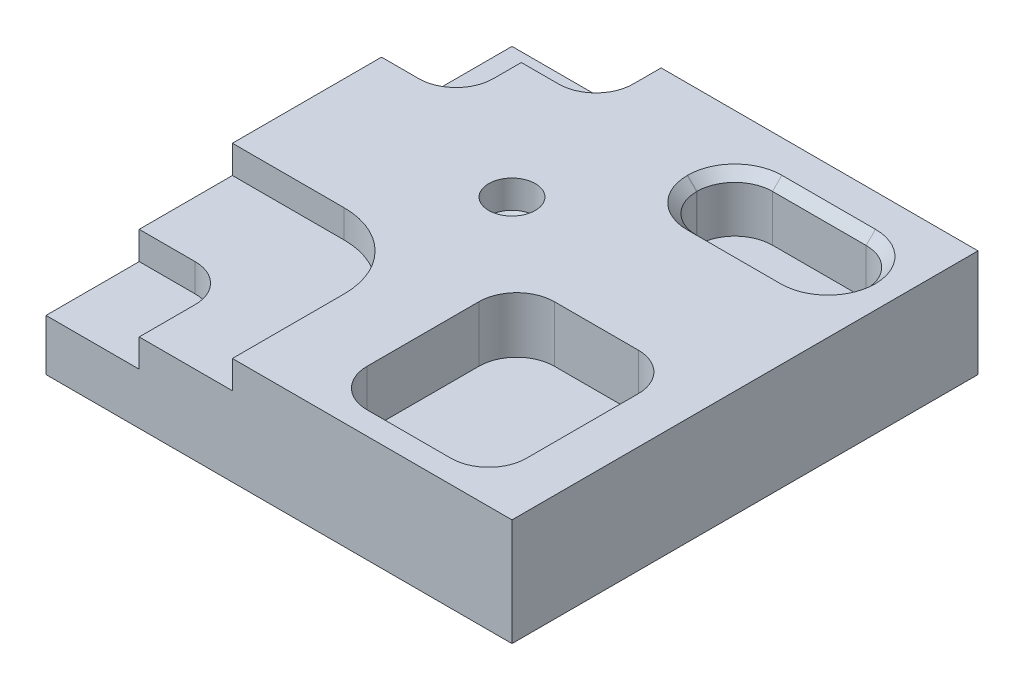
ISO-10303-21;
HEADER;
FILE_DESCRIPTION(('STEP AP214'),'2;1');
FILE_NAME('part.step','',(''),(''),'','','');
FILE_SCHEMA(('AUTOMOTIVE_DESIGN { 1 0 10303 214 1 1 1 1 }'));
ENDSEC;
DATA;
#1=APPLICATION_CONTEXT('core data for automotive mechanical design processes');
#2=APPLICATION_PROTOCOL_DEFINITION('international standard','automotive_design',2000,#1);
#3=PRODUCT_CONTEXT('',#1,'mechanical');
#4=PRODUCT('Part','Part','',(#3));
#5=PRODUCT_RELATED_PRODUCT_CATEGORY('part','',(#4));
#6=PRODUCT_DEFINITION_FORMATION('','',#4);
#7=PRODUCT_DEFINITION_CONTEXT('part definition',#1,'design');
#8=PRODUCT_DEFINITION('design','',#6,#7);
#9=PRODUCT_DEFINITION_SHAPE('','',#8);
#10=(LENGTH_UNIT() NAMED_UNIT(*) SI_UNIT(.MILLI.,.METRE.));
#11=(NAMED_UNIT(*) PLANE_ANGLE_UNIT() SI_UNIT($,.RADIAN.));
#12=(NAMED_UNIT(*) SI_UNIT($,.STERADIAN.) SOLID_ANGLE_UNIT());
#13=UNCERTAINTY_MEASURE_WITH_UNIT(LENGTH_MEASURE(1.E-05),#10,'distance_accuracy_value','');
#14=(GEOMETRIC_REPRESENTATION_CONTEXT(3) GLOBAL_UNCERTAINTY_ASSIGNED_CONTEXT((#13)) GLOBAL_UNIT_ASSIGNED_CONTEXT((#10,
#11,#12)) REPRESENTATION_CONTEXT('',''));
#15=CARTESIAN_POINT('',(0.,0.,0.));
#16=DIRECTION('',(0.,0.,1.));
#17=DIRECTION('',(1.,0.,0.));
#18=AXIS2_PLACEMENT_3D('',#15,#16,#17);
#19=CARTESIAN_POINT('',(-25.,11.5,25.));
#20=DIRECTION('',(1.,0.,0.));
#21=DIRECTION('',(0.,0.,-1.));
#22=AXIS2_PLACEMENT_3D('',#19,#20,#21);
#23=PLANE('',#22);
#24=DIRECTION('',(0.,0.,1.));
#25=VECTOR('',#24,1.);
#26=CARTESIAN_POINT('',(-25.,11.5,25.));
#27=LINE('',#26,#25);
#28=CARTESIAN_POINT('',(-25.,11.5,-11.));
#29=VERTEX_POINT('',#28);
#30=CARTESIAN_POINT('',(-25.,11.5,5.));
#31=VERTEX_POINT('',#30);
#32=EDGE_CURVE('E870',#29,#31,#27,.T.);
#33=ORIENTED_EDGE('',*,*,#32,.F.);
#34=DIRECTION('',(0.,1.,0.));
#35=VECTOR('',#34,1.);
#36=CARTESIAN_POINT('',(-25.,5.5,-11.));
#37=LINE('',#36,#35);
#38=CARTESIAN_POINT('',(-25.,5.5,-11.));
#39=VERTEX_POINT('',#38);
#40=EDGE_CURVE('E425',#39,#29,#37,.T.);
#41=ORIENTED_EDGE('',*,*,#40,.F.);
#42=DIRECTION('',(0.,0.,1.));
#43=VECTOR('',#42,1.);
#44=CARTESIAN_POINT('',(-25.,5.5,-25.));
#45=LINE('',#44,#43);
#46=CARTESIAN_POINT('',(-25.,5.5,-25.));
#47=VERTEX_POINT('',#46);
#48=EDGE_CURVE('E410',#47,#39,#45,.T.);
#49=ORIENTED_EDGE('',*,*,#48,.F.);
#50=DIRECTION('',(0.,-1.,0.));
#51=VECTOR('',#50,1.);
#52=CARTESIAN_POINT('',(-25.,11.5,-25.));
#53=LINE('',#52,#51);
#54=CARTESIAN_POINT('',(-25.,0.,-25.));
#55=VERTEX_POINT('',#54);
#56=EDGE_CURVE('E857',#47,#55,#53,.T.);
#57=ORIENTED_EDGE('',*,*,#56,.T.);
#58=DIRECTION('',(0.,0.,1.));
#59=VECTOR('',#58,1.);
#60=CARTESIAN_POINT('',(-25.,0.,25.));
#61=LINE('',#60,#59);
#62=CARTESIAN_POINT('',(-25.,0.,25.));
#63=VERTEX_POINT('',#62);
#64=EDGE_CURVE('E774',#55,#63,#61,.T.);
#65=ORIENTED_EDGE('',*,*,#64,.T.);
#66=DIRECTION('',(0.,-1.,0.));
#67=VECTOR('',#66,1.);
#68=CARTESIAN_POINT('',(-25.,11.5,25.));
#69=LINE('',#68,#67);
#70=CARTESIAN_POINT('',(-25.,5.5,25.));
#71=VERTEX_POINT('',#70);
#72=EDGE_CURVE('E802',#71,#63,#69,.T.);
#73=ORIENTED_EDGE('',*,*,#72,.F.);
#74=DIRECTION('',(0.,0.,1.));
#75=VECTOR('',#74,1.);
#76=CARTESIAN_POINT('',(-25.,5.5,0.));
#77=LINE('',#76,#75);
#78=CARTESIAN_POINT('',(-25.,5.5,15.));
#79=VERTEX_POINT('',#78);
#80=EDGE_CURVE('E767',#79,#71,#77,.T.);
#81=ORIENTED_EDGE('',*,*,#80,.F.);
#82=DIRECTION('',(0.,1.,0.));
#83=VECTOR('',#82,1.);
#84=CARTESIAN_POINT('',(-25.,5.5,15.));
#85=LINE('',#84,#83);
#86=CARTESIAN_POINT('',(-25.,8.5,15.));
#87=VERTEX_POINT('',#86);
#88=EDGE_CURVE('E766',#79,#87,#85,.T.);
#89=ORIENTED_EDGE('',*,*,#88,.T.);
#90=DIRECTION('',(0.,0.,1.));
#91=VECTOR('',#90,1.);
#92=CARTESIAN_POINT('',(-25.,8.5,25.));
#93=LINE('',#92,#91);
#94=CARTESIAN_POINT('',(-25.,8.5,5.));
#95=VERTEX_POINT('',#94);
#96=EDGE_CURVE('E734',#95,#87,#93,.T.);
#97=ORIENTED_EDGE('',*,*,#96,.F.);
#98=DIRECTION('',(0.,1.,0.));
#99=VECTOR('',#98,1.);
#100=CARTESIAN_POINT('',(-25.,8.5,5.));
#101=LINE('',#100,#99);
#102=EDGE_CURVE('E718',#95,#31,#101,.T.);
#103=ORIENTED_EDGE('',*,*,#102,.T.);
#104=EDGE_LOOP('',(#33,#41,#49,#57,#65,#73,#81,#89,#97,#103));
#105=FACE_BOUND('',#104,.T.);
#106=ADVANCED_FACE('F50',(#105),#23,.F.);
#107=CARTESIAN_POINT('',(0.,11.5,0.));
#108=DIRECTION('',(0.,1.,0.));
#109=DIRECTION('',(0.,0.,1.));
#110=AXIS2_PLACEMENT_3D('',#107,#108,#109);
#111=PLANE('',#110);
#112=DIRECTION('',(1.,0.,0.));
#113=VECTOR('',#112,1.);
#114=CARTESIAN_POINT('',(17.5,11.5,-21.5));
#115=LINE('',#114,#113);
#116=CARTESIAN_POINT('',(7.45,11.5,-21.5));
#117=VERTEX_POINT('',#116);
#118=CARTESIAN_POINT('',(17.5,11.5,-21.5));
#119=VERTEX_POINT('',#118);
#120=EDGE_CURVE('E519',#117,#119,#115,.T.);
#121=ORIENTED_EDGE('',*,*,#120,.T.);
#122=CARTESIAN_POINT('',(17.5,11.5,-16.45));
#123=DIRECTION('',(0.,1.,0.));
#124=DIRECTION('',(0.,0.,1.));
#125=AXIS2_PLACEMENT_3D('',#122,#123,#124);
#126=CIRCLE('',#125,5.04999999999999);
#127=CARTESIAN_POINT('',(22.55,11.5,-16.45));
#128=VERTEX_POINT('',#127);
#129=EDGE_CURVE('E523',#119,#128,#126,.F.);
#130=ORIENTED_EDGE('',*,*,#129,.T.);
#131=DIRECTION('',(0.,0.,1.));
#132=VECTOR('',#131,1.);
#133=CARTESIAN_POINT('',(22.55,11.5,-16.4));
#134=LINE('',#133,#132);
#135=CARTESIAN_POINT('',(22.55,11.5,-16.4));
#136=VERTEX_POINT('',#135);
#137=EDGE_CURVE('E515',#128,#136,#134,.T.);
#138=ORIENTED_EDGE('',*,*,#137,.T.);
#139=CARTESIAN_POINT('',(17.5,11.5,-16.4));
#140=DIRECTION('',(0.,1.,0.));
#141=DIRECTION('',(0.,0.,1.));
#142=AXIS2_PLACEMENT_3D('',#139,#140,#141);
#143=CIRCLE('',#142,5.05000000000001);
#144=CARTESIAN_POINT('',(17.5,11.5,-11.35));
#145=VERTEX_POINT('',#144);
#146=EDGE_CURVE('E509',#136,#145,#143,.F.);
#147=ORIENTED_EDGE('',*,*,#146,.T.);
#148=DIRECTION('',(-1.,0.,0.));
#149=VECTOR('',#148,1.);
#150=CARTESIAN_POINT('',(7.45,11.5,-11.35));
#151=LINE('',#150,#149);
#152=CARTESIAN_POINT('',(7.45,11.5,-11.35));
#153=VERTEX_POINT('',#152);
#154=EDGE_CURVE('E500',#145,#153,#151,.T.);
#155=ORIENTED_EDGE('',*,*,#154,.T.);
#156=CARTESIAN_POINT('',(7.45,11.5,-16.4));
#157=DIRECTION('',(0.,1.,0.));
#158=DIRECTION('',(0.,0.,1.));
#159=AXIS2_PLACEMENT_3D('',#156,#157,#158);
#160=CIRCLE('',#159,5.05000000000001);
#161=CARTESIAN_POINT('',(2.39999999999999,11.5,-16.4));
#162=VERTEX_POINT('',#161);
#163=EDGE_CURVE('E504',#153,#162,#160,.F.);
#164=ORIENTED_EDGE('',*,*,#163,.T.);
#165=DIRECTION('',(0.,0.,-1.));
#166=VECTOR('',#165,1.);
#167=CARTESIAN_POINT('',(2.39999999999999,11.5,-16.45));
#168=LINE('',#167,#166);
#169=CARTESIAN_POINT('',(2.39999999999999,11.5,-16.45));
#170=VERTEX_POINT('',#169);
#171=EDGE_CURVE('E512',#162,#170,#168,.T.);
#172=ORIENTED_EDGE('',*,*,#171,.T.);
#173=CARTESIAN_POINT('',(7.45,11.5,-16.45));
#174=DIRECTION('',(0.,1.,0.));
#175=DIRECTION('',(0.,0.,1.));
#176=AXIS2_PLACEMENT_3D('',#173,#174,#175);
#177=CIRCLE('',#176,5.04999999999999);
#178=EDGE_CURVE('E524',#170,#117,#177,.F.);
#179=ORIENTED_EDGE('',*,*,#178,.T.);
#180=EDGE_LOOP('',(#121,#130,#138,#147,#155,#164,#172,#179));
#181=FACE_BOUND('',#180,.T.);
#182=CARTESIAN_POINT('',(-4.99999999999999,11.5,-4.99999999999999));
#183=DIRECTION('',(0.,1.,0.));
#184=DIRECTION('',(0.,0.,1.));
#185=AXIS2_PLACEMENT_3D('',#182,#183,#184);
#186=CIRCLE('',#185,2.49999995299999);
#187=CARTESIAN_POINT('',(-4.99999999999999,11.5,-2.50000004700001));
#188=VERTEX_POINT('',#187);
#189=EDGE_CURVE('E1603',#188,#188,#186,.T.);
#190=ORIENTED_EDGE('',*,*,#189,.F.);
#191=EDGE_LOOP('',(#190));
#192=FACE_BOUND('',#191,.T.);
#193=DIRECTION('',(0.,0.,-1.));
#194=VECTOR('',#193,1.);
#195=CARTESIAN_POINT('',(-17.,11.5,-18.));
#196=LINE('',#195,#194);
#197=CARTESIAN_POINT('',(-17.,11.5,-15.));
#198=VERTEX_POINT('',#197);
#199=CARTESIAN_POINT('',(-17.,11.5,-18.));
#200=VERTEX_POINT('',#199);
#201=EDGE_CURVE('E360',#198,#200,#196,.T.);
#202=ORIENTED_EDGE('',*,*,#201,.F.);
#203=CARTESIAN_POINT('',(-21.,11.5,-15.));
#204=DIRECTION('',(0.,1.,0.));
#205=DIRECTION('',(0.,0.,1.));
#206=AXIS2_PLACEMENT_3D('',#203,#204,#205);
#207=CIRCLE('',#206,4.);
#208=CARTESIAN_POINT('',(-21.,11.5,-11.));
#209=VERTEX_POINT('',#208);
#210=EDGE_CURVE('E703',#198,#209,#207,.F.);
#211=ORIENTED_EDGE('',*,*,#210,.T.);
#212=DIRECTION('',(1.,0.,0.));
#213=VECTOR('',#212,1.);
#214=CARTESIAN_POINT('',(-25.,11.5,-11.));
#215=LINE('',#214,#213);
#216=EDGE_CURVE('E353',#29,#209,#215,.T.);
#217=ORIENTED_EDGE('',*,*,#216,.F.);
#218=ORIENTED_EDGE('',*,*,#32,.T.);
#219=DIRECTION('',(-1.,0.,0.));
#220=VECTOR('',#219,1.);
#221=CARTESIAN_POINT('',(-25.,11.5,5.));
#222=LINE('',#221,#220);
#223=CARTESIAN_POINT('',(-13.,11.5,5.));
#224=VERTEX_POINT('',#223);
#225=EDGE_CURVE('E737',#224,#31,#222,.T.);
#226=ORIENTED_EDGE('',*,*,#225,.F.);
#227=CARTESIAN_POINT('',(-13.,11.5,13.));
#228=DIRECTION('',(0.,1.,0.));
#229=DIRECTION('',(0.,0.,1.));
#230=AXIS2_PLACEMENT_3D('',#227,#228,#229);
#231=CIRCLE('',#230,8.);
#232=CARTESIAN_POINT('',(-5.,11.5,13.));
#233=VERTEX_POINT('',#232);
#234=EDGE_CURVE('E729',#224,#233,#231,.F.);
#235=ORIENTED_EDGE('',*,*,#234,.T.);
#236=DIRECTION('',(0.,0.,-1.));
#237=VECTOR('',#236,1.);
#238=CARTESIAN_POINT('',(-5.,11.5,25.));
#239=LINE('',#238,#237);
#240=CARTESIAN_POINT('',(-5.,11.5,25.));
#241=VERTEX_POINT('',#240);
#242=EDGE_CURVE('E753',#241,#233,#239,.T.);
#243=ORIENTED_EDGE('',*,*,#242,.F.);
#244=DIRECTION('',(1.,0.,0.));
#245=VECTOR('',#244,1.);
#246=CARTESIAN_POINT('',(25.,11.5,25.));
#247=LINE('',#246,#245);
#248=CARTESIAN_POINT('',(25.,11.5,25.));
#249=VERTEX_POINT('',#248);
#250=EDGE_CURVE('E867',#241,#249,#247,.T.);
#251=ORIENTED_EDGE('',*,*,#250,.T.);
#252=DIRECTION('',(0.,0.,-1.));
#253=VECTOR('',#252,1.);
#254=CARTESIAN_POINT('',(25.,11.5,25.));
#255=LINE('',#254,#253);
#256=CARTESIAN_POINT('',(25.,11.5,-25.));
#257=VERTEX_POINT('',#256);
#258=EDGE_CURVE('E864',#249,#257,#255,.T.);
#259=ORIENTED_EDGE('',*,*,#258,.T.);
#260=DIRECTION('',(-1.,0.,0.));
#261=VECTOR('',#260,1.);
#262=CARTESIAN_POINT('',(25.,11.5,-25.));
#263=LINE('',#262,#261);
#264=CARTESIAN_POINT('',(-9.,11.5,-25.));
#265=VERTEX_POINT('',#264);
#266=EDGE_CURVE('E860',#257,#265,#263,.T.);
#267=ORIENTED_EDGE('',*,*,#266,.T.);
#268=DIRECTION('',(0.,0.,-1.));
#269=VECTOR('',#268,1.);
#270=CARTESIAN_POINT('',(-9.,11.5,-25.));
#271=LINE('',#270,#269);
#272=CARTESIAN_POINT('',(-9.,11.5,-22.));
#273=VERTEX_POINT('',#272);
#274=EDGE_CURVE('E405',#273,#265,#271,.T.);
#275=ORIENTED_EDGE('',*,*,#274,.F.);
#276=CARTESIAN_POINT('',(-13.,11.5,-22.));
#277=DIRECTION('',(0.,1.,0.));
#278=DIRECTION('',(0.,0.,1.));
#279=AXIS2_PLACEMENT_3D('',#276,#277,#278);
#280=CIRCLE('',#279,4.);
#281=CARTESIAN_POINT('',(-13.,11.5,-18.));
#282=VERTEX_POINT('',#281);
#283=EDGE_CURVE('E811',#273,#282,#280,.F.);
#284=ORIENTED_EDGE('',*,*,#283,.T.);
#285=DIRECTION('',(1.,0.,0.));
#286=VECTOR('',#285,1.);
#287=CARTESIAN_POINT('',(-25.,11.5,-18.));
#288=LINE('',#287,#286);
#289=EDGE_CURVE('E400',#200,#282,#288,.T.);
#290=ORIENTED_EDGE('',*,*,#289,.F.);
#291=EDGE_LOOP('',(#202,#211,#217,#218,#226,#235,#243,#251,#259,#267,#275,#284,#290));
#292=FACE_BOUND('',#291,.T.);
#293=DIRECTION('',(0.,0.,-1.));
#294=VECTOR('',#293,1.);
#295=CARTESIAN_POINT('',(20.05,11.5,22.55));
#296=LINE('',#295,#294);
#297=CARTESIAN_POINT('',(20.05,11.5,18.5));
#298=VERTEX_POINT('',#297);
#299=CARTESIAN_POINT('',(20.05,11.5,6.50000000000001));
#300=VERTEX_POINT('',#299);
#301=EDGE_CURVE('E888',#298,#300,#296,.T.);
#302=ORIENTED_EDGE('',*,*,#301,.F.);
#303=CARTESIAN_POINT('',(16.,11.5,18.5));
#304=DIRECTION('',(0.,1.,0.));
#305=DIRECTION('',(0.,0.,1.));
#306=AXIS2_PLACEMENT_3D('',#303,#304,#305);
#307=CIRCLE('',#306,4.05);
#308=CARTESIAN_POINT('',(16.,11.5,22.55));
#309=VERTEX_POINT('',#308);
#310=EDGE_CURVE('E444',#298,#309,#307,.F.);
#311=ORIENTED_EDGE('',*,*,#310,.T.);
#312=DIRECTION('',(1.,0.,0.));
#313=VECTOR('',#312,1.);
#314=CARTESIAN_POINT('',(20.05,11.5,22.55));
#315=LINE('',#314,#313);
#316=CARTESIAN_POINT('',(7.,11.5,22.55));
#317=VERTEX_POINT('',#316);
#318=EDGE_CURVE('E1026',#317,#309,#315,.T.);
#319=ORIENTED_EDGE('',*,*,#318,.F.);
#320=CARTESIAN_POINT('',(7.,11.5,18.5));
#321=DIRECTION('',(0.,1.,0.));
#322=DIRECTION('',(0.,0.,1.));
#323=AXIS2_PLACEMENT_3D('',#320,#321,#322);
#324=CIRCLE('',#323,4.05);
#325=CARTESIAN_POINT('',(2.95,11.5,18.5));
#326=VERTEX_POINT('',#325);
#327=EDGE_CURVE('E447',#317,#326,#324,.F.);
#328=ORIENTED_EDGE('',*,*,#327,.T.);
#329=DIRECTION('',(0.,0.,1.));
#330=VECTOR('',#329,1.);
#331=CARTESIAN_POINT('',(2.95,11.5,22.55));
#332=LINE('',#331,#330);
#333=CARTESIAN_POINT('',(2.95,11.5,6.5));
#334=VERTEX_POINT('',#333);
#335=EDGE_CURVE('E1032',#334,#326,#332,.T.);
#336=ORIENTED_EDGE('',*,*,#335,.F.);
#337=CARTESIAN_POINT('',(7.,11.5,6.5));
#338=DIRECTION('',(0.,1.,0.));
#339=DIRECTION('',(0.,0.,1.));
#340=AXIS2_PLACEMENT_3D('',#337,#338,#339);
#341=CIRCLE('',#340,4.05);
#342=CARTESIAN_POINT('',(7.,11.5,2.45000000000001));
#343=VERTEX_POINT('',#342);
#344=EDGE_CURVE('E438',#334,#343,#341,.F.);
#345=ORIENTED_EDGE('',*,*,#344,.T.);
#346=DIRECTION('',(-1.,0.,0.));
#347=VECTOR('',#346,1.);
#348=CARTESIAN_POINT('',(20.05,11.5,2.45));
#349=LINE('',#348,#347);
#350=CARTESIAN_POINT('',(16.,11.5,2.45));
#351=VERTEX_POINT('',#350);
#352=EDGE_CURVE('E1038',#351,#343,#349,.T.);
#353=ORIENTED_EDGE('',*,*,#352,.F.);
#354=CARTESIAN_POINT('',(16.,11.5,6.50000000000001));
#355=DIRECTION('',(0.,1.,0.));
#356=DIRECTION('',(0.,0.,1.));
#357=AXIS2_PLACEMENT_3D('',#354,#355,#356);
#358=CIRCLE('',#357,4.05);
#359=EDGE_CURVE('E441',#351,#300,#358,.F.);
#360=ORIENTED_EDGE('',*,*,#359,.T.);
#361=EDGE_LOOP('',(#302,#311,#319,#328,#336,#345,#353,#360));
#362=FACE_BOUND('',#361,.T.);
#363=ADVANCED_FACE('F678',(#181,#192,#292,#362),#111,.T.);
#364=CARTESIAN_POINT('',(25.,11.5,25.));
#365=DIRECTION('',(0.,0.,-1.));
#366=DIRECTION('',(-1.,0.,0.));
#367=AXIS2_PLACEMENT_3D('',#364,#365,#366);
#368=PLANE('',#367);
#369=ORIENTED_EDGE('',*,*,#250,.F.);
#370=DIRECTION('',(0.,1.,0.));
#371=VECTOR('',#370,1.);
#372=CARTESIAN_POINT('',(-5.,8.5,25.));
#373=LINE('',#372,#371);
#374=CARTESIAN_POINT('',(-5.,8.5,25.));
#375=VERTEX_POINT('',#374);
#376=EDGE_CURVE('E716',#375,#241,#373,.T.);
#377=ORIENTED_EDGE('',*,*,#376,.F.);
#378=DIRECTION('',(1.,0.,0.));
#379=VECTOR('',#378,1.);
#380=CARTESIAN_POINT('',(-25.,8.5,25.));
#381=LINE('',#380,#379);
#382=CARTESIAN_POINT('',(-15.,8.5,25.));
#383=VERTEX_POINT('',#382);
#384=EDGE_CURVE('E736',#383,#375,#381,.T.);
#385=ORIENTED_EDGE('',*,*,#384,.F.);
#386=DIRECTION('',(0.,1.,0.));
#387=VECTOR('',#386,1.);
#388=CARTESIAN_POINT('',(-15.,5.5,25.));
#389=LINE('',#388,#387);
#390=CARTESIAN_POINT('',(-15.,5.5,25.));
#391=VERTEX_POINT('',#390);
#392=EDGE_CURVE('E763',#391,#383,#389,.T.);
#393=ORIENTED_EDGE('',*,*,#392,.F.);
#394=DIRECTION('',(1.,0.,0.));
#395=VECTOR('',#394,1.);
#396=CARTESIAN_POINT('',(0.,5.5,25.));
#397=LINE('',#396,#395);
#398=EDGE_CURVE('E776',#71,#391,#397,.T.);
#399=ORIENTED_EDGE('',*,*,#398,.F.);
#400=ORIENTED_EDGE('',*,*,#72,.T.);
#401=DIRECTION('',(1.,0.,0.));
#402=VECTOR('',#401,1.);
#403=CARTESIAN_POINT('',(25.,0.,25.));
#404=LINE('',#403,#402);
#405=CARTESIAN_POINT('',(25.,0.,25.));
#406=VERTEX_POINT('',#405);
#407=EDGE_CURVE('E880',#63,#406,#404,.T.);
#408=ORIENTED_EDGE('',*,*,#407,.T.);
#409=DIRECTION('',(0.,-1.,0.));
#410=VECTOR('',#409,1.);
#411=CARTESIAN_POINT('',(25.,11.5,25.));
#412=LINE('',#411,#410);
#413=EDGE_CURVE('E849',#249,#406,#412,.T.);
#414=ORIENTED_EDGE('',*,*,#413,.F.);
#415=EDGE_LOOP('',(#369,#377,#385,#393,#399,#400,#408,#414));
#416=FACE_BOUND('',#415,.T.);
#417=ADVANCED_FACE('F915',(#416),#368,.F.);
#418=CARTESIAN_POINT('',(25.,11.5,25.));
#419=DIRECTION('',(-1.,0.,0.));
#420=DIRECTION('',(0.,0.,1.));
#421=AXIS2_PLACEMENT_3D('',#418,#419,#420);
#422=PLANE('',#421);
#423=DIRECTION('',(0.,0.,-1.));
#424=VECTOR('',#423,1.);
#425=CARTESIAN_POINT('',(25.,0.,25.));
#426=LINE('',#425,#424);
#427=CARTESIAN_POINT('',(25.,0.,-25.));
#428=VERTEX_POINT('',#427);
#429=EDGE_CURVE('E877',#406,#428,#426,.T.);
#430=ORIENTED_EDGE('',*,*,#429,.T.);
#431=DIRECTION('',(0.,-1.,0.));
#432=VECTOR('',#431,1.);
#433=CARTESIAN_POINT('',(25.,11.5,-25.));
#434=LINE('',#433,#432);
#435=EDGE_CURVE('E853',#257,#428,#434,.T.);
#436=ORIENTED_EDGE('',*,*,#435,.F.);
#437=ORIENTED_EDGE('',*,*,#258,.F.);
#438=ORIENTED_EDGE('',*,*,#413,.T.);
#439=EDGE_LOOP('',(#430,#436,#437,#438));
#440=FACE_BOUND('',#439,.T.);
#441=ADVANCED_FACE('F922',(#440),#422,.F.);
#442=CARTESIAN_POINT('',(25.,11.5,-25.));
#443=DIRECTION('',(0.,0.,1.));
#444=DIRECTION('',(1.,0.,0.));
#445=AXIS2_PLACEMENT_3D('',#442,#443,#444);
#446=PLANE('',#445);
#447=DIRECTION('',(-1.,0.,0.));
#448=VECTOR('',#447,1.);
#449=CARTESIAN_POINT('',(-25.,5.5,-25.));
#450=LINE('',#449,#448);
#451=CARTESIAN_POINT('',(-9.,5.5,-25.));
#452=VERTEX_POINT('',#451);
#453=EDGE_CURVE('E394',#452,#47,#450,.T.);
#454=ORIENTED_EDGE('',*,*,#453,.F.);
#455=DIRECTION('',(0.,1.,0.));
#456=VECTOR('',#455,1.);
#457=CARTESIAN_POINT('',(-9.,5.5,-25.));
#458=LINE('',#457,#456);
#459=EDGE_CURVE('E399',#452,#265,#458,.T.);
#460=ORIENTED_EDGE('',*,*,#459,.T.);
#461=ORIENTED_EDGE('',*,*,#266,.F.);
#462=ORIENTED_EDGE('',*,*,#435,.T.);
#463=DIRECTION('',(-1.,0.,0.));
#464=VECTOR('',#463,1.);
#465=CARTESIAN_POINT('',(25.,0.,-25.));
#466=LINE('',#465,#464);
#467=EDGE_CURVE('E873',#428,#55,#466,.T.);
#468=ORIENTED_EDGE('',*,*,#467,.T.);
#469=ORIENTED_EDGE('',*,*,#56,.F.);
#470=EDGE_LOOP('',(#454,#460,#461,#462,#468,#469));
#471=FACE_BOUND('',#470,.T.);
#472=ADVANCED_FACE('F927',(#471),#446,.F.);
#473=CARTESIAN_POINT('',(0.,0.,0.));
#474=DIRECTION('',(0.,1.,0.));
#475=DIRECTION('',(0.,0.,1.));
#476=AXIS2_PLACEMENT_3D('',#473,#474,#475);
#477=PLANE('',#476);
#478=ORIENTED_EDGE('',*,*,#64,.F.);
#479=ORIENTED_EDGE('',*,*,#467,.F.);
#480=ORIENTED_EDGE('',*,*,#429,.F.);
#481=ORIENTED_EDGE('',*,*,#407,.F.);
#482=EDGE_LOOP('',(#478,#479,#480,#481));
#483=FACE_BOUND('',#482,.T.);
#484=ADVANCED_FACE('F1086',(#483),#477,.F.);
#485=CARTESIAN_POINT('',(0.,5.5,15.));
#486=DIRECTION('',(0.,0.,1.));
#487=DIRECTION('',(1.,0.,0.));
#488=AXIS2_PLACEMENT_3D('',#485,#486,#487);
#489=PLANE('',#488);
#490=DIRECTION('',(1.,0.,0.));
#491=VECTOR('',#490,1.);
#492=CARTESIAN_POINT('',(0.,5.5,15.));
#493=LINE('',#492,#491);
#494=CARTESIAN_POINT('',(-19.,5.5,15.));
#495=VERTEX_POINT('',#494);
#496=EDGE_CURVE('E782',#79,#495,#493,.T.);
#497=ORIENTED_EDGE('',*,*,#496,.T.);
#498=DIRECTION('',(0.,1.,0.));
#499=VECTOR('',#498,1.);
#500=CARTESIAN_POINT('',(-19.,5.5,15.));
#501=LINE('',#500,#499);
#502=CARTESIAN_POINT('',(-19.,8.5,15.));
#503=VERTEX_POINT('',#502);
#504=EDGE_CURVE('E749',#495,#503,#501,.T.);
#505=ORIENTED_EDGE('',*,*,#504,.T.);
#506=DIRECTION('',(1.,0.,0.));
#507=VECTOR('',#506,1.);
#508=CARTESIAN_POINT('',(0.,8.5,15.));
#509=LINE('',#508,#507);
#510=EDGE_CURVE('E726',#87,#503,#509,.T.);
#511=ORIENTED_EDGE('',*,*,#510,.F.);
#512=ORIENTED_EDGE('',*,*,#88,.F.);
#513=EDGE_LOOP('',(#497,#505,#511,#512));
#514=FACE_BOUND('',#513,.T.);
#515=ADVANCED_FACE('F1083',(#514),#489,.T.);
#516=CARTESIAN_POINT('',(-15.,5.5,0.));
#517=DIRECTION('',(1.,0.,0.));
#518=DIRECTION('',(0.,0.,-1.));
#519=AXIS2_PLACEMENT_3D('',#516,#517,#518);
#520=PLANE('',#519);
#521=DIRECTION('',(0.,0.,-1.));
#522=VECTOR('',#521,1.);
#523=CARTESIAN_POINT('',(-15.,8.5,0.));
#524=LINE('',#523,#522);
#525=CARTESIAN_POINT('',(-15.,8.5,19.));
#526=VERTEX_POINT('',#525);
#527=EDGE_CURVE('E715',#383,#526,#524,.T.);
#528=ORIENTED_EDGE('',*,*,#527,.T.);
#529=DIRECTION('',(0.,1.,0.));
#530=VECTOR('',#529,1.);
#531=CARTESIAN_POINT('',(-15.,5.5,19.));
#532=LINE('',#531,#530);
#533=CARTESIAN_POINT('',(-15.,5.5,19.));
#534=VERTEX_POINT('',#533);
#535=EDGE_CURVE('E761',#526,#534,#532,.F.);
#536=ORIENTED_EDGE('',*,*,#535,.T.);
#537=DIRECTION('',(0.,0.,-1.));
#538=VECTOR('',#537,1.);
#539=CARTESIAN_POINT('',(-15.,5.5,0.));
#540=LINE('',#539,#538);
#541=EDGE_CURVE('E779',#391,#534,#540,.T.);
#542=ORIENTED_EDGE('',*,*,#541,.F.);
#543=ORIENTED_EDGE('',*,*,#392,.T.);
#544=EDGE_LOOP('',(#528,#536,#542,#543));
#545=FACE_BOUND('',#544,.T.);
#546=ADVANCED_FACE('F1081',(#545),#520,.F.);
#547=CARTESIAN_POINT('',(0.,5.5,0.));
#548=DIRECTION('',(0.,1.,0.));
#549=DIRECTION('',(0.,0.,1.));
#550=AXIS2_PLACEMENT_3D('',#547,#548,#549);
#551=PLANE('',#550);
#552=ORIENTED_EDGE('',*,*,#541,.T.);
#553=CARTESIAN_POINT('',(-19.,5.5,19.));
#554=DIRECTION('',(0.,1.,0.));
#555=DIRECTION('',(0.,0.,1.));
#556=AXIS2_PLACEMENT_3D('',#553,#554,#555);
#557=CIRCLE('',#556,4.);
#558=EDGE_CURVE('E770',#534,#495,#557,.T.);
#559=ORIENTED_EDGE('',*,*,#558,.T.);
#560=ORIENTED_EDGE('',*,*,#496,.F.);
#561=ORIENTED_EDGE('',*,*,#80,.T.);
#562=ORIENTED_EDGE('',*,*,#398,.T.);
#563=EDGE_LOOP('',(#552,#559,#560,#561,#562));
#564=FACE_BOUND('',#563,.T.);
#565=ADVANCED_FACE('F1076',(#564),#551,.T.);
#566=CARTESIAN_POINT('',(-25.,8.5,5.));
#567=DIRECTION('',(0.,0.,-1.));
#568=DIRECTION('',(-1.,0.,0.));
#569=AXIS2_PLACEMENT_3D('',#566,#567,#568);
#570=PLANE('',#569);
#571=DIRECTION('',(-1.,0.,0.));
#572=VECTOR('',#571,1.);
#573=CARTESIAN_POINT('',(-25.,8.5,5.));
#574=LINE('',#573,#572);
#575=CARTESIAN_POINT('',(-13.,8.5,5.));
#576=VERTEX_POINT('',#575);
#577=EDGE_CURVE('E719',#576,#95,#574,.T.);
#578=ORIENTED_EDGE('',*,*,#577,.F.);
#579=DIRECTION('',(0.,1.,0.));
#580=VECTOR('',#579,1.);
#581=CARTESIAN_POINT('',(-13.,11.5,5.));
#582=LINE('',#581,#580);
#583=EDGE_CURVE('E711',#576,#224,#582,.T.);
#584=ORIENTED_EDGE('',*,*,#583,.T.);
#585=ORIENTED_EDGE('',*,*,#225,.T.);
#586=ORIENTED_EDGE('',*,*,#102,.F.);
#587=EDGE_LOOP('',(#578,#584,#585,#586));
#588=FACE_BOUND('',#587,.T.);
#589=ADVANCED_FACE('F899',(#588),#570,.F.);
#590=CARTESIAN_POINT('',(-5.,8.5,25.));
#591=DIRECTION('',(1.,0.,0.));
#592=DIRECTION('',(0.,0.,-1.));
#593=AXIS2_PLACEMENT_3D('',#590,#591,#592);
#594=PLANE('',#593);
#595=ORIENTED_EDGE('',*,*,#242,.T.);
#596=DIRECTION('',(0.,1.,0.));
#597=VECTOR('',#596,1.);
#598=CARTESIAN_POINT('',(-5.,8.5,13.));
#599=LINE('',#598,#597);
#600=CARTESIAN_POINT('',(-5.,8.5,13.));
#601=VERTEX_POINT('',#600);
#602=EDGE_CURVE('E714',#233,#601,#599,.F.);
#603=ORIENTED_EDGE('',*,*,#602,.T.);
#604=DIRECTION('',(0.,0.,-1.));
#605=VECTOR('',#604,1.);
#606=CARTESIAN_POINT('',(-5.,8.5,25.));
#607=LINE('',#606,#605);
#608=EDGE_CURVE('E732',#375,#601,#607,.T.);
#609=ORIENTED_EDGE('',*,*,#608,.F.);
#610=ORIENTED_EDGE('',*,*,#376,.T.);
#611=EDGE_LOOP('',(#595,#603,#609,#610));
#612=FACE_BOUND('',#611,.T.);
#613=ADVANCED_FACE('F906',(#612),#594,.F.);
#614=CARTESIAN_POINT('',(0.,8.5,0.));
#615=DIRECTION('',(0.,-1.,0.));
#616=DIRECTION('',(0.,0.,-1.));
#617=AXIS2_PLACEMENT_3D('',#614,#615,#616);
#618=PLANE('',#617);
#619=ORIENTED_EDGE('',*,*,#608,.T.);
#620=CARTESIAN_POINT('',(-13.,8.5,13.));
#621=DIRECTION('',(0.,-1.,0.));
#622=DIRECTION('',(0.,0.,-1.));
#623=AXIS2_PLACEMENT_3D('',#620,#621,#622);
#624=CIRCLE('',#623,8.);
#625=EDGE_CURVE('E722',#601,#576,#624,.F.);
#626=ORIENTED_EDGE('',*,*,#625,.T.);
#627=ORIENTED_EDGE('',*,*,#577,.T.);
#628=ORIENTED_EDGE('',*,*,#96,.T.);
#629=ORIENTED_EDGE('',*,*,#510,.T.);
#630=CARTESIAN_POINT('',(-19.,8.5,19.));
#631=DIRECTION('',(0.,-1.,0.));
#632=DIRECTION('',(0.,0.,-1.));
#633=AXIS2_PLACEMENT_3D('',#630,#631,#632);
#634=CIRCLE('',#633,4.);
#635=EDGE_CURVE('E788',#503,#526,#634,.T.);
#636=ORIENTED_EDGE('',*,*,#635,.T.);
#637=ORIENTED_EDGE('',*,*,#527,.F.);
#638=ORIENTED_EDGE('',*,*,#384,.T.);
#639=EDGE_LOOP('',(#619,#626,#627,#628,#629,#636,#637,#638));
#640=FACE_BOUND('',#639,.T.);
#641=ADVANCED_FACE('F912',(#640),#618,.F.);
#642=CARTESIAN_POINT('',(-13.,8.5,13.));
#643=DIRECTION('',(0.,-1.,0.));
#644=DIRECTION('',(0.,0.,-1.));
#645=AXIS2_PLACEMENT_3D('',#642,#643,#644);
#646=CYLINDRICAL_SURFACE('',#645,8.);
#647=ORIENTED_EDGE('',*,*,#625,.F.);
#648=ORIENTED_EDGE('',*,*,#602,.F.);
#649=ORIENTED_EDGE('',*,*,#234,.F.);
#650=ORIENTED_EDGE('',*,*,#583,.F.);
#651=EDGE_LOOP('',(#647,#648,#649,#650));
#652=FACE_BOUND('',#651,.T.);
#653=ADVANCED_FACE('F910',(#652),#646,.F.);
#654=CARTESIAN_POINT('',(-19.,5.5,19.));
#655=DIRECTION('',(0.,1.,0.));
#656=DIRECTION('',(0.,0.,1.));
#657=AXIS2_PLACEMENT_3D('',#654,#655,#656);
#658=CYLINDRICAL_SURFACE('',#657,4.);
#659=ORIENTED_EDGE('',*,*,#558,.F.);
#660=ORIENTED_EDGE('',*,*,#535,.F.);
#661=ORIENTED_EDGE('',*,*,#635,.F.);
#662=ORIENTED_EDGE('',*,*,#504,.F.);
#663=EDGE_LOOP('',(#659,#660,#661,#662));
#664=FACE_BOUND('',#663,.T.);
#665=ADVANCED_FACE('F957',(#664),#658,.F.);
#666=CARTESIAN_POINT('',(20.05,5.5,22.55));
#667=DIRECTION('',(1.,0.,0.));
#668=DIRECTION('',(0.,0.,-1.));
#669=AXIS2_PLACEMENT_3D('',#666,#667,#668);
#670=PLANE('',#669);
#671=DIRECTION('',(0.,0.,-1.));
#672=VECTOR('',#671,1.);
#673=CARTESIAN_POINT('',(20.05,5.5,22.55));
#674=LINE('',#673,#672);
#675=CARTESIAN_POINT('',(20.05,5.5,18.5));
#676=VERTEX_POINT('',#675);
#677=CARTESIAN_POINT('',(20.05,5.5,6.50000000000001));
#678=VERTEX_POINT('',#677);
#679=EDGE_CURVE('E1006',#676,#678,#674,.T.);
#680=ORIENTED_EDGE('',*,*,#679,.F.);
#681=DIRECTION('',(0.,1.,0.));
#682=VECTOR('',#681,1.);
#683=CARTESIAN_POINT('',(20.05,11.5,18.5));
#684=LINE('',#683,#682);
#685=EDGE_CURVE('E457',#676,#298,#684,.T.);
#686=ORIENTED_EDGE('',*,*,#685,.T.);
#687=ORIENTED_EDGE('',*,*,#301,.T.);
#688=DIRECTION('',(0.,1.,0.));
#689=VECTOR('',#688,1.);
#690=CARTESIAN_POINT('',(20.05,5.5,6.50000000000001));
#691=LINE('',#690,#689);
#692=EDGE_CURVE('E462',#300,#678,#691,.F.);
#693=ORIENTED_EDGE('',*,*,#692,.T.);
#694=EDGE_LOOP('',(#680,#686,#687,#693));
#695=FACE_BOUND('',#694,.T.);
#696=ADVANCED_FACE('F960',(#695),#670,.F.);
#697=CARTESIAN_POINT('',(20.05,5.5,22.55));
#698=DIRECTION('',(0.,0.,1.));
#699=DIRECTION('',(1.,0.,0.));
#700=AXIS2_PLACEMENT_3D('',#697,#698,#699);
#701=PLANE('',#700);
#702=DIRECTION('',(1.,0.,0.));
#703=VECTOR('',#702,1.);
#704=CARTESIAN_POINT('',(20.05,5.5,22.55));
#705=LINE('',#704,#703);
#706=CARTESIAN_POINT('',(7.,5.5,22.55));
#707=VERTEX_POINT('',#706);
#708=CARTESIAN_POINT('',(16.,5.5,22.55));
#709=VERTEX_POINT('',#708);
#710=EDGE_CURVE('E757',#707,#709,#705,.T.);
#711=ORIENTED_EDGE('',*,*,#710,.F.);
#712=DIRECTION('',(0.,1.,0.));
#713=VECTOR('',#712,1.);
#714=CARTESIAN_POINT('',(7.,11.5,22.55));
#715=LINE('',#714,#713);
#716=EDGE_CURVE('E469',#707,#317,#715,.T.);
#717=ORIENTED_EDGE('',*,*,#716,.T.);
#718=ORIENTED_EDGE('',*,*,#318,.T.);
#719=DIRECTION('',(0.,1.,0.));
#720=VECTOR('',#719,1.);
#721=CARTESIAN_POINT('',(16.,5.5,22.55));
#722=LINE('',#721,#720);
#723=EDGE_CURVE('E475',#309,#709,#722,.F.);
#724=ORIENTED_EDGE('',*,*,#723,.T.);
#725=EDGE_LOOP('',(#711,#717,#718,#724));
#726=FACE_BOUND('',#725,.T.);
#727=ADVANCED_FACE('F1059',(#726),#701,.F.);
#728=CARTESIAN_POINT('',(2.95,5.5,22.55));
#729=DIRECTION('',(-1.,0.,0.));
#730=DIRECTION('',(0.,0.,1.));
#731=AXIS2_PLACEMENT_3D('',#728,#729,#730);
#732=PLANE('',#731);
#733=ORIENTED_EDGE('',*,*,#335,.T.);
#734=DIRECTION('',(0.,1.,0.));
#735=VECTOR('',#734,1.);
#736=CARTESIAN_POINT('',(2.95,5.5,18.5));
#737=LINE('',#736,#735);
#738=CARTESIAN_POINT('',(2.95,5.5,18.5));
#739=VERTEX_POINT('',#738);
#740=EDGE_CURVE('E481',#326,#739,#737,.F.);
#741=ORIENTED_EDGE('',*,*,#740,.T.);
#742=DIRECTION('',(0.,0.,1.));
#743=VECTOR('',#742,1.);
#744=CARTESIAN_POINT('',(2.95,5.5,22.55));
#745=LINE('',#744,#743);
#746=CARTESIAN_POINT('',(2.95,5.5,6.5));
#747=VERTEX_POINT('',#746);
#748=EDGE_CURVE('E990',#747,#739,#745,.T.);
#749=ORIENTED_EDGE('',*,*,#748,.F.);
#750=DIRECTION('',(0.,1.,0.));
#751=VECTOR('',#750,1.);
#752=CARTESIAN_POINT('',(2.95,11.5,6.5));
#753=LINE('',#752,#751);
#754=EDGE_CURVE('E474',#747,#334,#753,.T.);
#755=ORIENTED_EDGE('',*,*,#754,.T.);
#756=EDGE_LOOP('',(#733,#741,#749,#755));
#757=FACE_BOUND('',#756,.T.);
#758=ADVANCED_FACE('F996',(#757),#732,.F.);
#759=CARTESIAN_POINT('',(20.05,5.5,2.45));
#760=DIRECTION('',(0.,0.,-1.));
#761=DIRECTION('',(-1.,0.,0.));
#762=AXIS2_PLACEMENT_3D('',#759,#760,#761);
#763=PLANE('',#762);
#764=DIRECTION('',(-1.,0.,0.));
#765=VECTOR('',#764,1.);
#766=CARTESIAN_POINT('',(20.05,5.5,2.45));
#767=LINE('',#766,#765);
#768=CARTESIAN_POINT('',(16.,5.5,2.45));
#769=VERTEX_POINT('',#768);
#770=CARTESIAN_POINT('',(7.,5.5,2.45000000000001));
#771=VERTEX_POINT('',#770);
#772=EDGE_CURVE('E993',#769,#771,#767,.T.);
#773=ORIENTED_EDGE('',*,*,#772,.F.);
#774=DIRECTION('',(0.,1.,0.));
#775=VECTOR('',#774,1.);
#776=CARTESIAN_POINT('',(16.,11.5,2.45000000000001));
#777=LINE('',#776,#775);
#778=EDGE_CURVE('E449',#769,#351,#777,.T.);
#779=ORIENTED_EDGE('',*,*,#778,.T.);
#780=ORIENTED_EDGE('',*,*,#352,.T.);
#781=DIRECTION('',(0.,1.,0.));
#782=VECTOR('',#781,1.);
#783=CARTESIAN_POINT('',(7.,5.5,2.45000000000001));
#784=LINE('',#783,#782);
#785=EDGE_CURVE('E454',#343,#771,#784,.F.);
#786=ORIENTED_EDGE('',*,*,#785,.T.);
#787=EDGE_LOOP('',(#773,#779,#780,#786));
#788=FACE_BOUND('',#787,.T.);
#789=ADVANCED_FACE('F1053',(#788),#763,.F.);
#790=CARTESIAN_POINT('',(0.,5.5,0.));
#791=DIRECTION('',(0.,1.,0.));
#792=DIRECTION('',(0.,0.,1.));
#793=AXIS2_PLACEMENT_3D('',#790,#791,#792);
#794=PLANE('',#793);
#795=ORIENTED_EDGE('',*,*,#748,.T.);
#796=CARTESIAN_POINT('',(7.,5.5,18.5));
#797=DIRECTION('',(0.,1.,0.));
#798=DIRECTION('',(0.,0.,1.));
#799=AXIS2_PLACEMENT_3D('',#796,#797,#798);
#800=CIRCLE('',#799,4.05);
#801=EDGE_CURVE('E845',#739,#707,#800,.T.);
#802=ORIENTED_EDGE('',*,*,#801,.T.);
#803=ORIENTED_EDGE('',*,*,#710,.T.);
#804=CARTESIAN_POINT('',(16.,5.5,18.5));
#805=DIRECTION('',(0.,1.,0.));
#806=DIRECTION('',(0.,0.,1.));
#807=AXIS2_PLACEMENT_3D('',#804,#805,#806);
#808=CIRCLE('',#807,4.05);
#809=EDGE_CURVE('E1019',#709,#676,#808,.T.);
#810=ORIENTED_EDGE('',*,*,#809,.T.);
#811=ORIENTED_EDGE('',*,*,#679,.T.);
#812=CARTESIAN_POINT('',(16.,5.5,6.50000000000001));
#813=DIRECTION('',(0.,1.,0.));
#814=DIRECTION('',(0.,0.,1.));
#815=AXIS2_PLACEMENT_3D('',#812,#813,#814);
#816=CIRCLE('',#815,4.05);
#817=EDGE_CURVE('E488',#678,#769,#816,.T.);
#818=ORIENTED_EDGE('',*,*,#817,.T.);
#819=ORIENTED_EDGE('',*,*,#772,.T.);
#820=CARTESIAN_POINT('',(7.,5.5,6.5));
#821=DIRECTION('',(0.,1.,0.));
#822=DIRECTION('',(0.,0.,1.));
#823=AXIS2_PLACEMENT_3D('',#820,#821,#822);
#824=CIRCLE('',#823,4.05);
#825=EDGE_CURVE('E484',#771,#747,#824,.T.);
#826=ORIENTED_EDGE('',*,*,#825,.T.);
#827=EDGE_LOOP('',(#795,#802,#803,#810,#811,#818,#819,#826));
#828=FACE_BOUND('',#827,.T.);
#829=ADVANCED_FACE('F966',(#828),#794,.T.);
#830=CARTESIAN_POINT('',(7.,5.5,18.5));
#831=DIRECTION('',(0.,-1.,0.));
#832=DIRECTION('',(0.,0.,-1.));
#833=AXIS2_PLACEMENT_3D('',#830,#831,#832);
#834=CYLINDRICAL_SURFACE('',#833,4.05);
#835=ORIENTED_EDGE('',*,*,#801,.F.);
#836=ORIENTED_EDGE('',*,*,#740,.F.);
#837=ORIENTED_EDGE('',*,*,#327,.F.);
#838=ORIENTED_EDGE('',*,*,#716,.F.);
#839=EDGE_LOOP('',(#835,#836,#837,#838));
#840=FACE_BOUND('',#839,.T.);
#841=ADVANCED_FACE('F962',(#840),#834,.F.);
#842=CARTESIAN_POINT('',(16.,5.5,18.5));
#843=DIRECTION('',(0.,-1.,0.));
#844=DIRECTION('',(0.,0.,-1.));
#845=AXIS2_PLACEMENT_3D('',#842,#843,#844);
#846=CYLINDRICAL_SURFACE('',#845,4.05);
#847=ORIENTED_EDGE('',*,*,#809,.F.);
#848=ORIENTED_EDGE('',*,*,#723,.F.);
#849=ORIENTED_EDGE('',*,*,#310,.F.);
#850=ORIENTED_EDGE('',*,*,#685,.F.);
#851=EDGE_LOOP('',(#847,#848,#849,#850));
#852=FACE_BOUND('',#851,.T.);
#853=ADVANCED_FACE('F965',(#852),#846,.F.);
#854=CARTESIAN_POINT('',(16.,5.5,6.50000000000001));
#855=DIRECTION('',(0.,-1.,0.));
#856=DIRECTION('',(0.,0.,-1.));
#857=AXIS2_PLACEMENT_3D('',#854,#855,#856);
#858=CYLINDRICAL_SURFACE('',#857,4.05);
#859=ORIENTED_EDGE('',*,*,#817,.F.);
#860=ORIENTED_EDGE('',*,*,#692,.F.);
#861=ORIENTED_EDGE('',*,*,#359,.F.);
#862=ORIENTED_EDGE('',*,*,#778,.F.);
#863=EDGE_LOOP('',(#859,#860,#861,#862));
#864=FACE_BOUND('',#863,.T.);
#865=ADVANCED_FACE('F970',(#864),#858,.F.);
#866=CARTESIAN_POINT('',(7.,5.5,6.5));
#867=DIRECTION('',(0.,-1.,0.));
#868=DIRECTION('',(0.,0.,-1.));
#869=AXIS2_PLACEMENT_3D('',#866,#867,#868);
#870=CYLINDRICAL_SURFACE('',#869,4.05);
#871=ORIENTED_EDGE('',*,*,#825,.F.);
#872=ORIENTED_EDGE('',*,*,#785,.F.);
#873=ORIENTED_EDGE('',*,*,#344,.F.);
#874=ORIENTED_EDGE('',*,*,#754,.F.);
#875=EDGE_LOOP('',(#871,#872,#873,#874));
#876=FACE_BOUND('',#875,.T.);
#877=ADVANCED_FACE('F974',(#876),#870,.F.);
#878=CARTESIAN_POINT('',(-9.,5.5,-25.));
#879=DIRECTION('',(1.,0.,0.));
#880=DIRECTION('',(0.,0.,-1.));
#881=AXIS2_PLACEMENT_3D('',#878,#879,#880);
#882=PLANE('',#881);
#883=DIRECTION('',(0.,0.,-1.));
#884=VECTOR('',#883,1.);
#885=CARTESIAN_POINT('',(-9.,5.5,-25.));
#886=LINE('',#885,#884);
#887=CARTESIAN_POINT('',(-9.,5.5,-22.));
#888=VERTEX_POINT('',#887);
#889=EDGE_CURVE('E391',#888,#452,#886,.T.);
#890=ORIENTED_EDGE('',*,*,#889,.F.);
#891=DIRECTION('',(0.,1.,0.));
#892=VECTOR('',#891,1.);
#893=CARTESIAN_POINT('',(-9.,11.5,-22.));
#894=LINE('',#893,#892);
#895=EDGE_CURVE('E433',#888,#273,#894,.T.);
#896=ORIENTED_EDGE('',*,*,#895,.T.);
#897=ORIENTED_EDGE('',*,*,#274,.T.);
#898=ORIENTED_EDGE('',*,*,#459,.F.);
#899=EDGE_LOOP('',(#890,#896,#897,#898));
#900=FACE_BOUND('',#899,.T.);
#901=ADVANCED_FACE('F932',(#900),#882,.F.);
#902=CARTESIAN_POINT('',(-25.,5.5,-18.));
#903=DIRECTION('',(0.,0.,1.));
#904=DIRECTION('',(1.,0.,0.));
#905=AXIS2_PLACEMENT_3D('',#902,#903,#904);
#906=PLANE('',#905);
#907=ORIENTED_EDGE('',*,*,#289,.T.);
#908=DIRECTION('',(0.,1.,0.));
#909=VECTOR('',#908,1.);
#910=CARTESIAN_POINT('',(-13.,5.5,-18.));
#911=LINE('',#910,#909);
#912=CARTESIAN_POINT('',(-13.,5.5,-18.));
#913=VERTEX_POINT('',#912);
#914=EDGE_CURVE('E377',#282,#913,#911,.F.);
#915=ORIENTED_EDGE('',*,*,#914,.T.);
#916=DIRECTION('',(1.,0.,0.));
#917=VECTOR('',#916,1.);
#918=CARTESIAN_POINT('',(-25.,5.5,-18.));
#919=LINE('',#918,#917);
#920=CARTESIAN_POINT('',(-17.,5.5,-18.));
#921=VERTEX_POINT('',#920);
#922=EDGE_CURVE('E395',#921,#913,#919,.T.);
#923=ORIENTED_EDGE('',*,*,#922,.F.);
#924=DIRECTION('',(0.,1.,0.));
#925=VECTOR('',#924,1.);
#926=CARTESIAN_POINT('',(-17.,5.5,-18.));
#927=LINE('',#926,#925);
#928=EDGE_CURVE('E406',#921,#200,#927,.T.);
#929=ORIENTED_EDGE('',*,*,#928,.T.);
#930=EDGE_LOOP('',(#907,#915,#923,#929));
#931=FACE_BOUND('',#930,.T.);
#932=ADVANCED_FACE('F838',(#931),#906,.F.);
#933=CARTESIAN_POINT('',(0.,5.5,0.));
#934=DIRECTION('',(0.,1.,0.));
#935=DIRECTION('',(0.,0.,1.));
#936=AXIS2_PLACEMENT_3D('',#933,#934,#935);
#937=PLANE('',#936);
#938=ORIENTED_EDGE('',*,*,#922,.T.);
#939=CARTESIAN_POINT('',(-13.,5.5,-22.));
#940=DIRECTION('',(0.,1.,0.));
#941=DIRECTION('',(0.,0.,1.));
#942=AXIS2_PLACEMENT_3D('',#939,#940,#941);
#943=CIRCLE('',#942,4.);
#944=EDGE_CURVE('E376',#913,#888,#943,.T.);
#945=ORIENTED_EDGE('',*,*,#944,.T.);
#946=ORIENTED_EDGE('',*,*,#889,.T.);
#947=ORIENTED_EDGE('',*,*,#453,.T.);
#948=ORIENTED_EDGE('',*,*,#48,.T.);
#949=DIRECTION('',(1.,0.,0.));
#950=VECTOR('',#949,1.);
#951=CARTESIAN_POINT('',(-25.,5.5,-11.));
#952=LINE('',#951,#950);
#953=CARTESIAN_POINT('',(-21.,5.5,-11.));
#954=VERTEX_POINT('',#953);
#955=EDGE_CURVE('E354',#39,#954,#952,.T.);
#956=ORIENTED_EDGE('',*,*,#955,.T.);
#957=CARTESIAN_POINT('',(-21.,5.5,-15.));
#958=DIRECTION('',(0.,1.,0.));
#959=DIRECTION('',(0.,0.,1.));
#960=AXIS2_PLACEMENT_3D('',#957,#958,#959);
#961=CIRCLE('',#960,4.);
#962=CARTESIAN_POINT('',(-17.,5.5,-15.));
#963=VERTEX_POINT('',#962);
#964=EDGE_CURVE('E371',#954,#963,#961,.T.);
#965=ORIENTED_EDGE('',*,*,#964,.T.);
#966=DIRECTION('',(0.,0.,-1.));
#967=VECTOR('',#966,1.);
#968=CARTESIAN_POINT('',(-17.,5.5,-18.));
#969=LINE('',#968,#967);
#970=EDGE_CURVE('E359',#963,#921,#969,.T.);
#971=ORIENTED_EDGE('',*,*,#970,.T.);
#972=EDGE_LOOP('',(#938,#945,#946,#947,#948,#956,#965,#971));
#973=FACE_BOUND('',#972,.T.);
#974=ADVANCED_FACE('F934',(#973),#937,.T.);
#975=CARTESIAN_POINT('',(-17.,5.5,-18.));
#976=DIRECTION('',(1.,0.,0.));
#977=DIRECTION('',(0.,0.,-1.));
#978=AXIS2_PLACEMENT_3D('',#975,#976,#977);
#979=PLANE('',#978);
#980=ORIENTED_EDGE('',*,*,#970,.F.);
#981=DIRECTION('',(0.,1.,0.));
#982=VECTOR('',#981,1.);
#983=CARTESIAN_POINT('',(-17.,11.5,-15.));
#984=LINE('',#983,#982);
#985=EDGE_CURVE('E381',#963,#198,#984,.T.);
#986=ORIENTED_EDGE('',*,*,#985,.T.);
#987=ORIENTED_EDGE('',*,*,#201,.T.);
#988=ORIENTED_EDGE('',*,*,#928,.F.);
#989=EDGE_LOOP('',(#980,#986,#987,#988));
#990=FACE_BOUND('',#989,.T.);
#991=ADVANCED_FACE('F830',(#990),#979,.F.);
#992=CARTESIAN_POINT('',(-25.,5.5,-11.));
#993=DIRECTION('',(0.,0.,1.));
#994=DIRECTION('',(1.,0.,0.));
#995=AXIS2_PLACEMENT_3D('',#992,#993,#994);
#996=PLANE('',#995);
#997=ORIENTED_EDGE('',*,*,#216,.T.);
#998=DIRECTION('',(0.,1.,0.));
#999=VECTOR('',#998,1.);
#1000=CARTESIAN_POINT('',(-21.,5.5,-11.));
#1001=LINE('',#1000,#999);
#1002=EDGE_CURVE('E814',#209,#954,#1001,.F.);
#1003=ORIENTED_EDGE('',*,*,#1002,.T.);
#1004=ORIENTED_EDGE('',*,*,#955,.F.);
#1005=ORIENTED_EDGE('',*,*,#40,.T.);
#1006=EDGE_LOOP('',(#997,#1003,#1004,#1005));
#1007=FACE_BOUND('',#1006,.T.);
#1008=ADVANCED_FACE('F890',(#1007),#996,.F.);
#1009=CARTESIAN_POINT('',(-13.,5.5,-22.));
#1010=DIRECTION('',(0.,-1.,0.));
#1011=DIRECTION('',(0.,0.,-1.));
#1012=AXIS2_PLACEMENT_3D('',#1009,#1010,#1011);
#1013=CYLINDRICAL_SURFACE('',#1012,4.);
#1014=ORIENTED_EDGE('',*,*,#944,.F.);
#1015=ORIENTED_EDGE('',*,*,#914,.F.);
#1016=ORIENTED_EDGE('',*,*,#283,.F.);
#1017=ORIENTED_EDGE('',*,*,#895,.F.);
#1018=EDGE_LOOP('',(#1014,#1015,#1016,#1017));
#1019=FACE_BOUND('',#1018,.T.);
#1020=ADVANCED_FACE('F842',(#1019),#1013,.F.);
#1021=CARTESIAN_POINT('',(-21.,5.5,-15.));
#1022=DIRECTION('',(0.,-1.,0.));
#1023=DIRECTION('',(0.,0.,-1.));
#1024=AXIS2_PLACEMENT_3D('',#1021,#1022,#1023);
#1025=CYLINDRICAL_SURFACE('',#1024,4.);
#1026=ORIENTED_EDGE('',*,*,#964,.F.);
#1027=ORIENTED_EDGE('',*,*,#1002,.F.);
#1028=ORIENTED_EDGE('',*,*,#210,.F.);
#1029=ORIENTED_EDGE('',*,*,#985,.F.);
#1030=EDGE_LOOP('',(#1026,#1027,#1028,#1029));
#1031=FACE_BOUND('',#1030,.T.);
#1032=ADVANCED_FACE('F935',(#1031),#1025,.F.);
#1033=CARTESIAN_POINT('',(21.55,5.5,-20.5));
#1034=DIRECTION('',(1.,0.,0.));
#1035=DIRECTION('',(0.,0.,-1.));
#1036=AXIS2_PLACEMENT_3D('',#1033,#1034,#1035);
#1037=PLANE('',#1036);
#1038=DIRECTION('',(0.,1.,0.));
#1039=VECTOR('',#1038,1.);
#1040=CARTESIAN_POINT('',(21.55,11.5,-16.4));
#1041=LINE('',#1040,#1039);
#1042=CARTESIAN_POINT('',(21.55,5.5,-16.4));
#1043=VERTEX_POINT('',#1042);
#1044=CARTESIAN_POINT('',(21.55,10.5,-16.4));
#1045=VERTEX_POINT('',#1044);
#1046=EDGE_CURVE('E610',#1043,#1045,#1041,.T.);
#1047=ORIENTED_EDGE('',*,*,#1046,.T.);
#1048=DIRECTION('',(0.,0.,-1.));
#1049=VECTOR('',#1048,1.);
#1050=CARTESIAN_POINT('',(21.55,10.5,-16.45));
#1051=LINE('',#1050,#1049);
#1052=CARTESIAN_POINT('',(21.55,10.5,-16.45));
#1053=VERTEX_POINT('',#1052);
#1054=EDGE_CURVE('E549',#1045,#1053,#1051,.T.);
#1055=ORIENTED_EDGE('',*,*,#1054,.T.);
#1056=DIRECTION('',(0.,1.,0.));
#1057=VECTOR('',#1056,1.);
#1058=CARTESIAN_POINT('',(21.55,5.5,-16.45));
#1059=LINE('',#1058,#1057);
#1060=CARTESIAN_POINT('',(21.55,5.5,-16.45));
#1061=VERTEX_POINT('',#1060);
#1062=EDGE_CURVE('E697',#1053,#1061,#1059,.F.);
#1063=ORIENTED_EDGE('',*,*,#1062,.T.);
#1064=DIRECTION('',(0.,0.,-1.));
#1065=VECTOR('',#1064,1.);
#1066=CARTESIAN_POINT('',(21.55,5.5,-20.5));
#1067=LINE('',#1066,#1065);
#1068=EDGE_CURVE('E317',#1043,#1061,#1067,.T.);
#1069=ORIENTED_EDGE('',*,*,#1068,.F.);
#1070=EDGE_LOOP('',(#1047,#1055,#1063,#1069));
#1071=FACE_BOUND('',#1070,.T.);
#1072=ADVANCED_FACE('F695',(#1071),#1037,.F.);
#1073=CARTESIAN_POINT('',(21.55,5.5,-12.35));
#1074=DIRECTION('',(0.,0.,1.));
#1075=DIRECTION('',(1.,0.,0.));
#1076=AXIS2_PLACEMENT_3D('',#1073,#1074,#1075);
#1077=PLANE('',#1076);
#1078=DIRECTION('',(0.,1.,0.));
#1079=VECTOR('',#1078,1.);
#1080=CARTESIAN_POINT('',(7.45,11.5,-12.35));
#1081=LINE('',#1080,#1079);
#1082=CARTESIAN_POINT('',(7.45,5.5,-12.35));
#1083=VERTEX_POINT('',#1082);
#1084=CARTESIAN_POINT('',(7.45,10.5,-12.35));
#1085=VERTEX_POINT('',#1084);
#1086=EDGE_CURVE('E605',#1083,#1085,#1081,.T.);
#1087=ORIENTED_EDGE('',*,*,#1086,.T.);
#1088=DIRECTION('',(1.,0.,0.));
#1089=VECTOR('',#1088,1.);
#1090=CARTESIAN_POINT('',(17.5,10.5,-12.35));
#1091=LINE('',#1090,#1089);
#1092=CARTESIAN_POINT('',(17.5,10.5,-12.35));
#1093=VERTEX_POINT('',#1092);
#1094=EDGE_CURVE('E12',#1085,#1093,#1091,.T.);
#1095=ORIENTED_EDGE('',*,*,#1094,.T.);
#1096=DIRECTION('',(0.,1.,0.));
#1097=VECTOR('',#1096,1.);
#1098=CARTESIAN_POINT('',(17.5,5.5,-12.35));
#1099=LINE('',#1098,#1097);
#1100=CARTESIAN_POINT('',(17.5,5.5,-12.35));
#1101=VERTEX_POINT('',#1100);
#1102=EDGE_CURVE('E609',#1093,#1101,#1099,.F.);
#1103=ORIENTED_EDGE('',*,*,#1102,.T.);
#1104=DIRECTION('',(1.,0.,0.));
#1105=VECTOR('',#1104,1.);
#1106=CARTESIAN_POINT('',(21.55,5.5,-12.35));
#1107=LINE('',#1106,#1105);
#1108=EDGE_CURVE('E348',#1083,#1101,#1107,.T.);
#1109=ORIENTED_EDGE('',*,*,#1108,.F.);
#1110=EDGE_LOOP('',(#1087,#1095,#1103,#1109));
#1111=FACE_BOUND('',#1110,.T.);
#1112=ADVANCED_FACE('F942',(#1111),#1077,.F.);
#1113=CARTESIAN_POINT('',(3.4,5.5,-20.5));
#1114=DIRECTION('',(-1.,0.,0.));
#1115=DIRECTION('',(0.,0.,1.));
#1116=AXIS2_PLACEMENT_3D('',#1113,#1114,#1115);
#1117=PLANE('',#1116);
#1118=DIRECTION('',(0.,1.,0.));
#1119=VECTOR('',#1118,1.);
#1120=CARTESIAN_POINT('',(3.4,11.5,-16.45));
#1121=LINE('',#1120,#1119);
#1122=CARTESIAN_POINT('',(3.4,5.5,-16.45));
#1123=VERTEX_POINT('',#1122);
#1124=CARTESIAN_POINT('',(3.4,10.5,-16.45));
#1125=VERTEX_POINT('',#1124);
#1126=EDGE_CURVE('E627',#1123,#1125,#1121,.T.);
#1127=ORIENTED_EDGE('',*,*,#1126,.T.);
#1128=DIRECTION('',(0.,0.,1.));
#1129=VECTOR('',#1128,1.);
#1130=CARTESIAN_POINT('',(3.4,10.5,-16.4));
#1131=LINE('',#1130,#1129);
#1132=CARTESIAN_POINT('',(3.4,10.5,-16.4));
#1133=VERTEX_POINT('',#1132);
#1134=EDGE_CURVE('E552',#1125,#1133,#1131,.T.);
#1135=ORIENTED_EDGE('',*,*,#1134,.T.);
#1136=DIRECTION('',(0.,1.,0.));
#1137=VECTOR('',#1136,1.);
#1138=CARTESIAN_POINT('',(3.4,5.5,-16.4));
#1139=LINE('',#1138,#1137);
#1140=CARTESIAN_POINT('',(3.4,5.5,-16.4));
#1141=VERTEX_POINT('',#1140);
#1142=EDGE_CURVE('E632',#1133,#1141,#1139,.F.);
#1143=ORIENTED_EDGE('',*,*,#1142,.T.);
#1144=DIRECTION('',(0.,0.,1.));
#1145=VECTOR('',#1144,1.);
#1146=CARTESIAN_POINT('',(3.4,5.5,-20.5));
#1147=LINE('',#1146,#1145);
#1148=EDGE_CURVE('E344',#1123,#1141,#1147,.T.);
#1149=ORIENTED_EDGE('',*,*,#1148,.F.);
#1150=EDGE_LOOP('',(#1127,#1135,#1143,#1149));
#1151=FACE_BOUND('',#1150,.T.);
#1152=ADVANCED_FACE('F659',(#1151),#1117,.F.);
#1153=CARTESIAN_POINT('',(21.55,5.5,-20.5));
#1154=DIRECTION('',(0.,0.,-1.));
#1155=DIRECTION('',(-1.,0.,0.));
#1156=AXIS2_PLACEMENT_3D('',#1153,#1154,#1155);
#1157=PLANE('',#1156);
#1158=DIRECTION('',(0.,1.,0.));
#1159=VECTOR('',#1158,1.);
#1160=CARTESIAN_POINT('',(17.5,11.5,-20.5));
#1161=LINE('',#1160,#1159);
#1162=CARTESIAN_POINT('',(17.5,5.5,-20.5));
#1163=VERTEX_POINT('',#1162);
#1164=CARTESIAN_POINT('',(17.5,10.5,-20.5));
#1165=VERTEX_POINT('',#1164);
#1166=EDGE_CURVE('E634',#1163,#1165,#1161,.T.);
#1167=ORIENTED_EDGE('',*,*,#1166,.T.);
#1168=DIRECTION('',(-1.,0.,0.));
#1169=VECTOR('',#1168,1.);
#1170=CARTESIAN_POINT('',(7.45,10.5,-20.5));
#1171=LINE('',#1170,#1169);
#1172=CARTESIAN_POINT('',(7.45,10.5,-20.5));
#1173=VERTEX_POINT('',#1172);
#1174=EDGE_CURVE('E533',#1165,#1173,#1171,.T.);
#1175=ORIENTED_EDGE('',*,*,#1174,.T.);
#1176=DIRECTION('',(0.,1.,0.));
#1177=VECTOR('',#1176,1.);
#1178=CARTESIAN_POINT('',(7.45,5.5,-20.5));
#1179=LINE('',#1178,#1177);
#1180=CARTESIAN_POINT('',(7.45,5.5,-20.5));
#1181=VERTEX_POINT('',#1180);
#1182=EDGE_CURVE('E505',#1173,#1181,#1179,.F.);
#1183=ORIENTED_EDGE('',*,*,#1182,.T.);
#1184=DIRECTION('',(-1.,0.,0.));
#1185=VECTOR('',#1184,1.);
#1186=CARTESIAN_POINT('',(21.55,5.5,-20.5));
#1187=LINE('',#1186,#1185);
#1188=EDGE_CURVE('E324',#1163,#1181,#1187,.T.);
#1189=ORIENTED_EDGE('',*,*,#1188,.F.);
#1190=EDGE_LOOP('',(#1167,#1175,#1183,#1189));
#1191=FACE_BOUND('',#1190,.T.);
#1192=ADVANCED_FACE('F643',(#1191),#1157,.F.);
#1193=CARTESIAN_POINT('',(0.,5.5,0.));
#1194=DIRECTION('',(0.,-1.,0.));
#1195=DIRECTION('',(0.,0.,-1.));
#1196=AXIS2_PLACEMENT_3D('',#1193,#1194,#1195);
#1197=PLANE('',#1196);
#1198=ORIENTED_EDGE('',*,*,#1108,.T.);
#1199=CARTESIAN_POINT('',(17.5,5.5,-16.4));
#1200=DIRECTION('',(0.,-1.,0.));
#1201=DIRECTION('',(0.,0.,-1.));
#1202=AXIS2_PLACEMENT_3D('',#1199,#1200,#1201);
#1203=CIRCLE('',#1202,4.05);
#1204=EDGE_CURVE('E624',#1101,#1043,#1203,.F.);
#1205=ORIENTED_EDGE('',*,*,#1204,.T.);
#1206=ORIENTED_EDGE('',*,*,#1068,.T.);
#1207=CARTESIAN_POINT('',(17.5,5.5,-16.45));
#1208=DIRECTION('',(0.,-1.,0.));
#1209=DIRECTION('',(0.,0.,-1.));
#1210=AXIS2_PLACEMENT_3D('',#1207,#1208,#1209);
#1211=CIRCLE('',#1210,4.05);
#1212=EDGE_CURVE('E615',#1061,#1163,#1211,.F.);
#1213=ORIENTED_EDGE('',*,*,#1212,.T.);
#1214=ORIENTED_EDGE('',*,*,#1188,.T.);
#1215=CARTESIAN_POINT('',(7.45,5.5,-16.45));
#1216=DIRECTION('',(0.,-1.,0.));
#1217=DIRECTION('',(0.,0.,-1.));
#1218=AXIS2_PLACEMENT_3D('',#1215,#1216,#1217);
#1219=CIRCLE('',#1218,4.05);
#1220=EDGE_CURVE('E618',#1181,#1123,#1219,.F.);
#1221=ORIENTED_EDGE('',*,*,#1220,.T.);
#1222=ORIENTED_EDGE('',*,*,#1148,.T.);
#1223=CARTESIAN_POINT('',(7.45,5.5,-16.4));
#1224=DIRECTION('',(0.,-1.,0.));
#1225=DIRECTION('',(0.,0.,-1.));
#1226=AXIS2_PLACEMENT_3D('',#1223,#1224,#1225);
#1227=CIRCLE('',#1226,4.05);
#1228=EDGE_CURVE('E621',#1141,#1083,#1227,.F.);
#1229=ORIENTED_EDGE('',*,*,#1228,.T.);
#1230=EDGE_LOOP('',(#1198,#1205,#1206,#1213,#1214,#1221,#1222,#1229));
#1231=FACE_BOUND('',#1230,.T.);
#1232=ADVANCED_FACE('F651',(#1231),#1197,.F.);
#1233=CARTESIAN_POINT('',(17.5,5.5,-16.4));
#1234=DIRECTION('',(0.,-1.,0.));
#1235=DIRECTION('',(0.,0.,-1.));
#1236=AXIS2_PLACEMENT_3D('',#1233,#1234,#1235);
#1237=CYLINDRICAL_SURFACE('',#1236,4.05);
#1238=ORIENTED_EDGE('',*,*,#1102,.F.);
#1239=CARTESIAN_POINT('',(17.5,10.5,-16.4));
#1240=DIRECTION('',(0.,1.,0.));
#1241=DIRECTION('',(0.,0.,1.));
#1242=AXIS2_PLACEMENT_3D('',#1239,#1240,#1241);
#1243=CIRCLE('',#1242,4.05);
#1244=EDGE_CURVE('E580',#1093,#1045,#1243,.T.);
#1245=ORIENTED_EDGE('',*,*,#1244,.T.);
#1246=ORIENTED_EDGE('',*,*,#1046,.F.);
#1247=ORIENTED_EDGE('',*,*,#1204,.F.);
#1248=EDGE_LOOP('',(#1238,#1245,#1246,#1247));
#1249=FACE_BOUND('',#1248,.T.);
#1250=ADVANCED_FACE('F1316',(#1249),#1237,.F.);
#1251=CARTESIAN_POINT('',(7.45,5.5,-16.4));
#1252=DIRECTION('',(0.,-1.,0.));
#1253=DIRECTION('',(0.,0.,-1.));
#1254=AXIS2_PLACEMENT_3D('',#1251,#1252,#1253);
#1255=CYLINDRICAL_SURFACE('',#1254,4.05);
#1256=ORIENTED_EDGE('',*,*,#1142,.F.);
#1257=CARTESIAN_POINT('',(7.45,10.5,-16.4));
#1258=DIRECTION('',(0.,1.,0.));
#1259=DIRECTION('',(0.,0.,1.));
#1260=AXIS2_PLACEMENT_3D('',#1257,#1258,#1259);
#1261=CIRCLE('',#1260,4.05);
#1262=EDGE_CURVE('E62',#1133,#1085,#1261,.T.);
#1263=ORIENTED_EDGE('',*,*,#1262,.T.);
#1264=ORIENTED_EDGE('',*,*,#1086,.F.);
#1265=ORIENTED_EDGE('',*,*,#1228,.F.);
#1266=EDGE_LOOP('',(#1256,#1263,#1264,#1265));
#1267=FACE_BOUND('',#1266,.T.);
#1268=ADVANCED_FACE('F1325',(#1267),#1255,.F.);
#1269=CARTESIAN_POINT('',(7.45,5.5,-16.45));
#1270=DIRECTION('',(0.,-1.,0.));
#1271=DIRECTION('',(0.,0.,-1.));
#1272=AXIS2_PLACEMENT_3D('',#1269,#1270,#1271);
#1273=CYLINDRICAL_SURFACE('',#1272,4.05);
#1274=ORIENTED_EDGE('',*,*,#1182,.F.);
#1275=CARTESIAN_POINT('',(7.45,10.5,-16.45));
#1276=DIRECTION('',(0.,1.,0.));
#1277=DIRECTION('',(0.,0.,1.));
#1278=AXIS2_PLACEMENT_3D('',#1275,#1276,#1277);
#1279=CIRCLE('',#1278,4.05);
#1280=EDGE_CURVE('E545',#1173,#1125,#1279,.T.);
#1281=ORIENTED_EDGE('',*,*,#1280,.T.);
#1282=ORIENTED_EDGE('',*,*,#1126,.F.);
#1283=ORIENTED_EDGE('',*,*,#1220,.F.);
#1284=EDGE_LOOP('',(#1274,#1281,#1282,#1283));
#1285=FACE_BOUND('',#1284,.T.);
#1286=ADVANCED_FACE('F656',(#1285),#1273,.F.);
#1287=CARTESIAN_POINT('',(17.5,5.5,-16.45));
#1288=DIRECTION('',(0.,-1.,0.));
#1289=DIRECTION('',(0.,0.,-1.));
#1290=AXIS2_PLACEMENT_3D('',#1287,#1288,#1289);
#1291=CYLINDRICAL_SURFACE('',#1290,4.05);
#1292=ORIENTED_EDGE('',*,*,#1062,.F.);
#1293=CARTESIAN_POINT('',(17.5,10.5,-16.45));
#1294=DIRECTION('',(0.,1.,0.));
#1295=DIRECTION('',(0.,0.,1.));
#1296=AXIS2_PLACEMENT_3D('',#1293,#1294,#1295);
#1297=CIRCLE('',#1296,4.05);
#1298=EDGE_CURVE('E528',#1053,#1165,#1297,.T.);
#1299=ORIENTED_EDGE('',*,*,#1298,.T.);
#1300=ORIENTED_EDGE('',*,*,#1166,.F.);
#1301=ORIENTED_EDGE('',*,*,#1212,.F.);
#1302=EDGE_LOOP('',(#1292,#1299,#1300,#1301));
#1303=FACE_BOUND('',#1302,.T.);
#1304=ADVANCED_FACE('F701',(#1303),#1291,.F.);
#1305=CARTESIAN_POINT('',(-4.99999999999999,8.5,-4.99999999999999));
#1306=DIRECTION('',(0.,1.,0.));
#1307=DIRECTION('',(0.,0.,1.));
#1308=AXIS2_PLACEMENT_3D('',#1305,#1306,#1307);
#1309=CONICAL_SURFACE('',#1308,2.499999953,1.02974425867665);
#1310=CARTESIAN_POINT('',(-4.99999999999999,8.5,-4.99999999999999));
#1311=DIRECTION('',(0.,1.,0.));
#1312=DIRECTION('',(0.,0.,1.));
#1313=AXIS2_PLACEMENT_3D('',#1310,#1311,#1312);
#1314=CIRCLE('',#1313,2.499999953);
#1315=CARTESIAN_POINT('',(-4.99999999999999,8.5,-2.500000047));
#1316=VERTEX_POINT('',#1315);
#1317=EDGE_CURVE('E327',#1316,#1316,#1314,.T.);
#1318=ORIENTED_EDGE('',*,*,#1317,.T.);
#1319=EDGE_LOOP('',(#1318));
#1320=FACE_BOUND('',#1319,.T.);
#1321=CARTESIAN_POINT('',(-4.99999999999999,7.8991394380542,-4.99999999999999));
#1322=DIRECTION('',(0.,1.,0.));
#1323=DIRECTION('',(0.,0.,1.));
#1324=AXIS2_PLACEMENT_3D('',#1321,#1322,#1323);
#1325=CIRCLE('',#1324,1.500000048);
#1326=CARTESIAN_POINT('',(-4.99999999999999,7.8991394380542,-3.49999995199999));
#1327=VERTEX_POINT('',#1326);
#1328=EDGE_CURVE('E318',#1327,#1327,#1325,.T.);
#1329=ORIENTED_EDGE('',*,*,#1328,.F.);
#1330=EDGE_LOOP('',(#1329));
#1331=FACE_BOUND('',#1330,.T.);
#1332=ADVANCED_FACE('F1350',(#1320,#1331),#1309,.F.);
#1333=CARTESIAN_POINT('',(-4.99999999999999,11.5,-4.99999999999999));
#1334=DIRECTION('',(0.,1.,0.));
#1335=DIRECTION('',(0.,0.,1.));
#1336=AXIS2_PLACEMENT_3D('',#1333,#1334,#1335);
#1337=CYLINDRICAL_SURFACE('',#1336,2.49999995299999);
#1338=ORIENTED_EDGE('',*,*,#1317,.F.);
#1339=EDGE_LOOP('',(#1338));
#1340=FACE_BOUND('',#1339,.T.);
#1341=ORIENTED_EDGE('',*,*,#189,.T.);
#1342=EDGE_LOOP('',(#1341));
#1343=FACE_BOUND('',#1342,.T.);
#1344=ADVANCED_FACE('F310',(#1340,#1343),#1337,.F.);
#1345=CARTESIAN_POINT('',(-4.99999999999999,5.5,-4.99999999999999));
#1346=DIRECTION('',(0.,1.,0.));
#1347=DIRECTION('',(0.,0.,1.));
#1348=AXIS2_PLACEMENT_3D('',#1345,#1346,#1347);
#1349=CONICAL_SURFACE('',#1348,1.500000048,1.02974425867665);
#1350=CARTESIAN_POINT('',(-5.,4.59870904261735,-4.99999999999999));
#1351=VERTEX_POINT('',#1350);
#1352=VERTEX_LOOP('',#1351);
#1353=FACE_BOUND('',#1352,.T.);
#1354=CARTESIAN_POINT('',(-4.99999999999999,5.5,-4.99999999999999));
#1355=DIRECTION('',(0.,1.,0.));
#1356=DIRECTION('',(0.,0.,1.));
#1357=AXIS2_PLACEMENT_3D('',#1354,#1355,#1356);
#1358=CIRCLE('',#1357,1.500000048);
#1359=CARTESIAN_POINT('',(-4.99999999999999,5.5,-3.499999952));
#1360=VERTEX_POINT('',#1359);
#1361=EDGE_CURVE('E314',#1360,#1360,#1358,.T.);
#1362=ORIENTED_EDGE('',*,*,#1361,.T.);
#1363=EDGE_LOOP('',(#1362));
#1364=FACE_BOUND('',#1363,.T.);
#1365=ADVANCED_FACE('F306',(#1353,#1364),#1349,.F.);
#1366=CARTESIAN_POINT('',(-4.99999999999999,11.5,-4.99999999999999));
#1367=DIRECTION('',(0.,1.,0.));
#1368=DIRECTION('',(0.,0.,1.));
#1369=AXIS2_PLACEMENT_3D('',#1366,#1367,#1368);
#1370=CYLINDRICAL_SURFACE('',#1369,1.500000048);
#1371=ORIENTED_EDGE('',*,*,#1328,.T.);
#1372=EDGE_LOOP('',(#1371));
#1373=FACE_BOUND('',#1372,.T.);
#1374=ORIENTED_EDGE('',*,*,#1361,.F.);
#1375=EDGE_LOOP('',(#1374));
#1376=FACE_BOUND('',#1375,.T.);
#1377=ADVANCED_FACE('F309',(#1373,#1376),#1370,.F.);
#1378=CARTESIAN_POINT('',(7.45,11.5,-16.4));
#1379=DIRECTION('',(0.,1.,0.));
#1380=DIRECTION('',(0.,0.,1.));
#1381=AXIS2_PLACEMENT_3D('',#1378,#1379,#1380);
#1382=CONICAL_SURFACE('',#1381,5.05000000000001,0.785398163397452);
#1383=DIRECTION('',(0.,0.707106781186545,0.70710678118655));
#1384=VECTOR('',#1383,1.);
#1385=CARTESIAN_POINT('',(7.45,10.5,-12.35));
#1386=LINE('',#1385,#1384);
#1387=EDGE_CURVE('E588',#1085,#153,#1386,.T.);
#1388=ORIENTED_EDGE('',*,*,#1387,.F.);
#1389=ORIENTED_EDGE('',*,*,#1262,.F.);
#1390=DIRECTION('',(0.70710678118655,-0.707106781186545,0.));
#1391=VECTOR('',#1390,1.);
#1392=CARTESIAN_POINT('',(2.39999999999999,11.5,-16.4));
#1393=LINE('',#1392,#1391);
#1394=EDGE_CURVE('E55',#162,#1133,#1393,.T.);
#1395=ORIENTED_EDGE('',*,*,#1394,.F.);
#1396=ORIENTED_EDGE('',*,*,#163,.F.);
#1397=EDGE_LOOP('',(#1388,#1389,#1395,#1396));
#1398=FACE_BOUND('',#1397,.T.);
#1399=ADVANCED_FACE('F53',(#1398),#1382,.F.);
#1400=CARTESIAN_POINT('',(3.4,10.5,-20.5));
#1401=DIRECTION('',(0.707106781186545,0.70710678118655,0.));
#1402=DIRECTION('',(0.,0.,-1.));
#1403=AXIS2_PLACEMENT_3D('',#1400,#1401,#1402);
#1404=PLANE('',#1403);
#1405=ORIENTED_EDGE('',*,*,#1394,.T.);
#1406=ORIENTED_EDGE('',*,*,#1134,.F.);
#1407=DIRECTION('',(0.70710678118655,-0.707106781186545,0.));
#1408=VECTOR('',#1407,1.);
#1409=CARTESIAN_POINT('',(2.39999999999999,11.5,-16.45));
#1410=LINE('',#1409,#1408);
#1411=EDGE_CURVE('E593',#170,#1125,#1410,.T.);
#1412=ORIENTED_EDGE('',*,*,#1411,.F.);
#1413=ORIENTED_EDGE('',*,*,#171,.F.);
#1414=EDGE_LOOP('',(#1405,#1406,#1412,#1413));
#1415=FACE_BOUND('',#1414,.T.);
#1416=ADVANCED_FACE('F663',(#1415),#1404,.T.);
#1417=CARTESIAN_POINT('',(21.55,10.5,-12.35));
#1418=DIRECTION('',(0.,0.70710678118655,-0.707106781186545));
#1419=DIRECTION('',(-1.,0.,0.));
#1420=AXIS2_PLACEMENT_3D('',#1417,#1418,#1419);
#1421=PLANE('',#1420);
#1422=ORIENTED_EDGE('',*,*,#1387,.T.);
#1423=ORIENTED_EDGE('',*,*,#154,.F.);
#1424=DIRECTION('',(0.,0.707106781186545,0.70710678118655));
#1425=VECTOR('',#1424,1.);
#1426=CARTESIAN_POINT('',(17.5,10.5,-12.35));
#1427=LINE('',#1426,#1425);
#1428=EDGE_CURVE('E597',#1093,#145,#1427,.T.);
#1429=ORIENTED_EDGE('',*,*,#1428,.F.);
#1430=ORIENTED_EDGE('',*,*,#1094,.F.);
#1431=EDGE_LOOP('',(#1422,#1423,#1429,#1430));
#1432=FACE_BOUND('',#1431,.T.);
#1433=ADVANCED_FACE('F1396',(#1432),#1421,.T.);
#1434=CARTESIAN_POINT('',(7.45,11.5,-16.45));
#1435=DIRECTION('',(0.,1.,0.));
#1436=DIRECTION('',(0.,0.,1.));
#1437=AXIS2_PLACEMENT_3D('',#1434,#1435,#1436);
#1438=CONICAL_SURFACE('',#1437,5.04999999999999,0.785398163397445);
#1439=ORIENTED_EDGE('',*,*,#1411,.T.);
#1440=ORIENTED_EDGE('',*,*,#1280,.F.);
#1441=DIRECTION('',(0.,-0.707106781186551,0.707106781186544));
#1442=VECTOR('',#1441,1.);
#1443=CARTESIAN_POINT('',(7.45,11.5,-21.5));
#1444=LINE('',#1443,#1442);
#1445=EDGE_CURVE('E574',#117,#1173,#1444,.T.);
#1446=ORIENTED_EDGE('',*,*,#1445,.F.);
#1447=ORIENTED_EDGE('',*,*,#178,.F.);
#1448=EDGE_LOOP('',(#1439,#1440,#1446,#1447));
#1449=FACE_BOUND('',#1448,.T.);
#1450=ADVANCED_FACE('F669',(#1449),#1438,.F.);
#1451=CARTESIAN_POINT('',(17.5,11.5,-16.4));
#1452=DIRECTION('',(0.,1.,0.));
#1453=DIRECTION('',(0.,0.,1.));
#1454=AXIS2_PLACEMENT_3D('',#1451,#1452,#1453);
#1455=CONICAL_SURFACE('',#1454,5.05000000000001,0.785398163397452);
#1456=ORIENTED_EDGE('',*,*,#1428,.T.);
#1457=ORIENTED_EDGE('',*,*,#146,.F.);
#1458=DIRECTION('',(0.70710678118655,0.707106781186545,0.));
#1459=VECTOR('',#1458,1.);
#1460=CARTESIAN_POINT('',(21.55,10.5,-16.4));
#1461=LINE('',#1460,#1459);
#1462=EDGE_CURVE('E568',#1045,#136,#1461,.T.);
#1463=ORIENTED_EDGE('',*,*,#1462,.F.);
#1464=ORIENTED_EDGE('',*,*,#1244,.F.);
#1465=EDGE_LOOP('',(#1456,#1457,#1463,#1464));
#1466=FACE_BOUND('',#1465,.T.);
#1467=ADVANCED_FACE('F687',(#1466),#1455,.F.);
#1468=CARTESIAN_POINT('',(21.55,10.5,-20.5));
#1469=DIRECTION('',(0.,0.707106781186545,0.70710678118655));
#1470=DIRECTION('',(1.,0.,0.));
#1471=AXIS2_PLACEMENT_3D('',#1468,#1469,#1470);
#1472=PLANE('',#1471);
#1473=ORIENTED_EDGE('',*,*,#1445,.T.);
#1474=ORIENTED_EDGE('',*,*,#1174,.F.);
#1475=DIRECTION('',(0.,-0.707106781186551,0.707106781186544));
#1476=VECTOR('',#1475,1.);
#1477=CARTESIAN_POINT('',(17.5,11.5,-21.5));
#1478=LINE('',#1477,#1476);
#1479=EDGE_CURVE('E564',#119,#1165,#1478,.T.);
#1480=ORIENTED_EDGE('',*,*,#1479,.F.);
#1481=ORIENTED_EDGE('',*,*,#120,.F.);
#1482=EDGE_LOOP('',(#1473,#1474,#1480,#1481));
#1483=FACE_BOUND('',#1482,.T.);
#1484=ADVANCED_FACE('F708',(#1483),#1472,.T.);
#1485=CARTESIAN_POINT('',(21.55,10.5,-20.5));
#1486=DIRECTION('',(-0.707106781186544,0.707106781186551,0.));
#1487=DIRECTION('',(0.,0.,1.));
#1488=AXIS2_PLACEMENT_3D('',#1485,#1486,#1487);
#1489=PLANE('',#1488);
#1490=ORIENTED_EDGE('',*,*,#1462,.T.);
#1491=ORIENTED_EDGE('',*,*,#137,.F.);
#1492=DIRECTION('',(0.70710678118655,0.707106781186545,0.));
#1493=VECTOR('',#1492,1.);
#1494=CARTESIAN_POINT('',(21.55,10.5,-16.45));
#1495=LINE('',#1494,#1493);
#1496=EDGE_CURVE('E569',#1053,#128,#1495,.T.);
#1497=ORIENTED_EDGE('',*,*,#1496,.F.);
#1498=ORIENTED_EDGE('',*,*,#1054,.F.);
#1499=EDGE_LOOP('',(#1490,#1491,#1497,#1498));
#1500=FACE_BOUND('',#1499,.T.);
#1501=ADVANCED_FACE('F691',(#1500),#1489,.T.);
#1502=CARTESIAN_POINT('',(17.5,11.5,-16.45));
#1503=DIRECTION('',(0.,1.,0.));
#1504=DIRECTION('',(0.,0.,1.));
#1505=AXIS2_PLACEMENT_3D('',#1502,#1503,#1504);
#1506=CONICAL_SURFACE('',#1505,5.04999999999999,0.785398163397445);
#1507=ORIENTED_EDGE('',*,*,#1479,.T.);
#1508=ORIENTED_EDGE('',*,*,#1298,.F.);
#1509=ORIENTED_EDGE('',*,*,#1496,.T.);
#1510=ORIENTED_EDGE('',*,*,#129,.F.);
#1511=EDGE_LOOP('',(#1507,#1508,#1509,#1510));
#1512=FACE_BOUND('',#1511,.T.);
#1513=ADVANCED_FACE('F705',(#1512),#1506,.F.);
#1514=CLOSED_SHELL('',(#106,#363,#417,#441,#472,#484,#515,#546,#565,#589,#613,#641,#653,#665,
#696,#727,#758,#789,#829,#841,#853,#865,#877,#901,#932,#974,#991,#1008,#1020,#1032,#1072,#1112,
#1152,#1192,#1232,#1250,#1268,#1286,#1304,#1332,#1344,#1365,#1377,#1399,#1416,#1433,#1450,#1467,
#1484,#1501,#1513));
#1515=MANIFOLD_SOLID_BREP('B2',#1514);
#1516=ADVANCED_BREP_SHAPE_REPRESENTATION('',(#18,#1515),#14);
#1517=SHAPE_DEFINITION_REPRESENTATION(#9,#1516);
ENDSEC;
END-ISO-10303-21;
